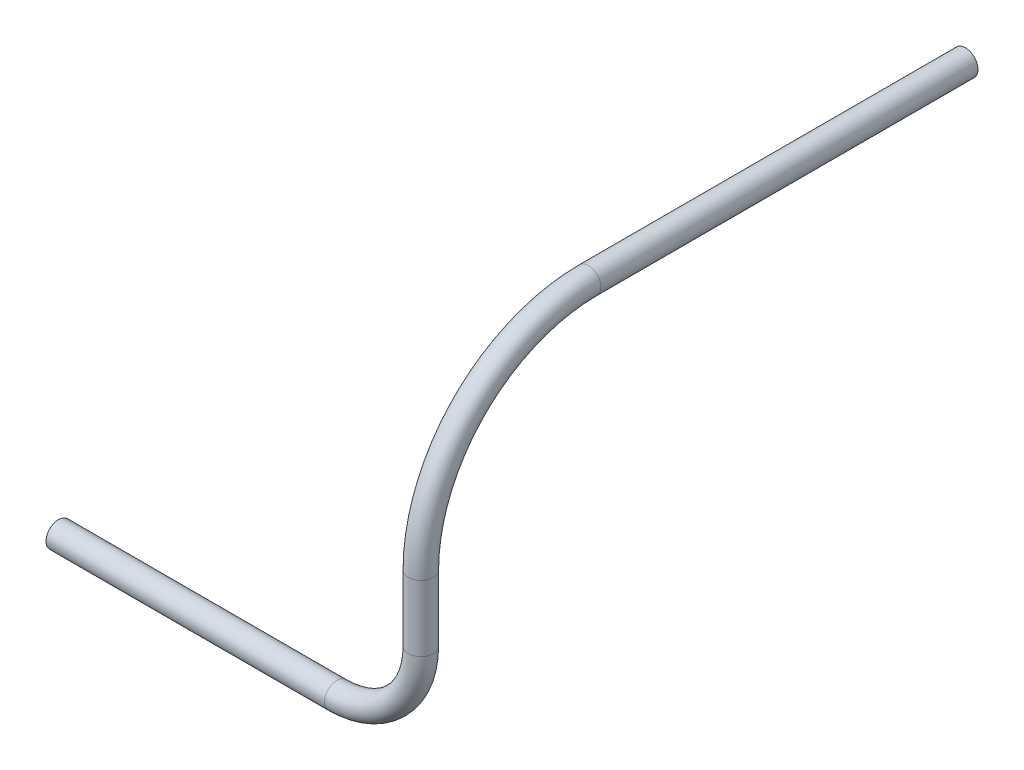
from build123d import *

# Parameters (mm, degrees)
SKETCH1_R = 3.81
SKETCH7_R = 3.81


with BuildPart() as part:
    # Sweep1: sweep along a path in Sketch2
    with BuildLine(Plane(origin=(-38.1, 0, 0), x_dir=(0, 0, -1), z_dir=(1, 0, 0))) as sweep1_path:
        Line((0, 12.7), (-114.3, 12.7))
        ThreePointArc((-114.3, 12.7), (-150.221024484, -2.178975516), (-165.1, -38.1))
    # Sketch1 → Sweep1 (sweep)
    with BuildSketch(Plane.XY):
        with Locations((-38.1, 12.7)):
            Circle(SKETCH1_R)
    sweep(path=sweep1_path.line)

    # Sweep2: sweep along a path in Sketch6
    with BuildLine(Plane(origin=(0, 0, 165.1), x_dir=(-1, 0, 0), z_dir=(0, 0, -1))) as sweep2_path:
        Line((38.1, -38.1), (38.1, -58.1025))
        ThreePointArc((38.1, -58.1025), (45.539487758, -76.063012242), (63.5, -83.5025))
        Line((63.5, -83.5025), (88.9, -83.5025))
        Line((88.9, -83.5025), (147.913662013, -83.5025))
    # Sketch7 → Sweep2 (sweep)
    with BuildSketch(Plane.XZ.offset(38.1)):
        with Locations((-38.1, 165.1)):
            Circle(SKETCH7_R)
    sweep(path=sweep2_path.line)


solid = part.part
